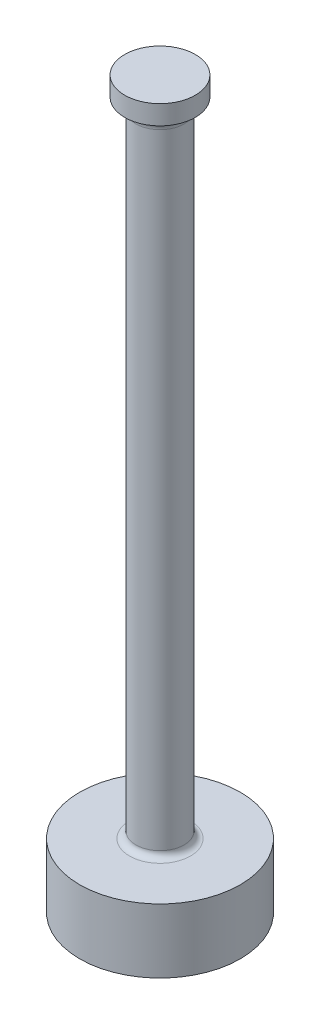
ISO-10303-21;
HEADER;
FILE_DESCRIPTION(('STEP AP214'),'2;1');
FILE_NAME('part.step','',(''),(''),'','','');
FILE_SCHEMA(('AUTOMOTIVE_DESIGN { 1 0 10303 214 1 1 1 1 }'));
ENDSEC;
DATA;
#1=APPLICATION_CONTEXT('core data for automotive mechanical design processes');
#2=APPLICATION_PROTOCOL_DEFINITION('international standard','automotive_design',2000,#1);
#3=PRODUCT_CONTEXT('',#1,'mechanical');
#4=PRODUCT('Part','Part','',(#3));
#5=PRODUCT_RELATED_PRODUCT_CATEGORY('part','',(#4));
#6=PRODUCT_DEFINITION_FORMATION('','',#4);
#7=PRODUCT_DEFINITION_CONTEXT('part definition',#1,'design');
#8=PRODUCT_DEFINITION('design','',#6,#7);
#9=PRODUCT_DEFINITION_SHAPE('','',#8);
#10=(LENGTH_UNIT() NAMED_UNIT(*) SI_UNIT(.MILLI.,.METRE.));
#11=(NAMED_UNIT(*) PLANE_ANGLE_UNIT() SI_UNIT($,.RADIAN.));
#12=(NAMED_UNIT(*) SI_UNIT($,.STERADIAN.) SOLID_ANGLE_UNIT());
#13=UNCERTAINTY_MEASURE_WITH_UNIT(LENGTH_MEASURE(1.E-05),#10,'distance_accuracy_value','');
#14=(GEOMETRIC_REPRESENTATION_CONTEXT(3) GLOBAL_UNCERTAINTY_ASSIGNED_CONTEXT((#13)) GLOBAL_UNIT_ASSIGNED_CONTEXT((#10,
#11,#12)) REPRESENTATION_CONTEXT('',''));
#15=CARTESIAN_POINT('',(0.,0.,0.));
#16=DIRECTION('',(0.,0.,1.));
#17=DIRECTION('',(1.,0.,0.));
#18=AXIS2_PLACEMENT_3D('',#15,#16,#17);
#19=CARTESIAN_POINT('',(0.,200.,0.));
#20=DIRECTION('',(0.,-1.,0.));
#21=DIRECTION('',(0.,0.,-1.));
#22=AXIS2_PLACEMENT_3D('',#19,#20,#21);
#23=CYLINDRICAL_SURFACE('',#22,250.);
#24=CARTESIAN_POINT('',(0.,200.,0.));
#25=DIRECTION('',(0.,1.,0.));
#26=DIRECTION('',(0.,0.,1.));
#27=AXIS2_PLACEMENT_3D('',#24,#25,#26);
#28=CIRCLE('',#27,250.);
#29=CARTESIAN_POINT('',(0.,200.,250.));
#30=VERTEX_POINT('',#29);
#31=EDGE_CURVE('E52',#30,#30,#28,.T.);
#32=ORIENTED_EDGE('',*,*,#31,.F.);
#33=EDGE_LOOP('',(#32));
#34=FACE_BOUND('',#33,.T.);
#35=CARTESIAN_POINT('',(0.,0.,0.));
#36=DIRECTION('',(0.,1.,0.));
#37=DIRECTION('',(0.,0.,1.));
#38=AXIS2_PLACEMENT_3D('',#35,#36,#37);
#39=CIRCLE('',#38,250.);
#40=CARTESIAN_POINT('',(0.,0.,250.));
#41=VERTEX_POINT('',#40);
#42=EDGE_CURVE('E55',#41,#41,#39,.T.);
#43=ORIENTED_EDGE('',*,*,#42,.T.);
#44=EDGE_LOOP('',(#43));
#45=FACE_BOUND('',#44,.T.);
#46=ADVANCED_FACE('F37',(#34,#45),#23,.T.);
#47=CARTESIAN_POINT('',(0.,200.,0.));
#48=DIRECTION('',(0.,1.,0.));
#49=DIRECTION('',(0.,0.,1.));
#50=AXIS2_PLACEMENT_3D('',#47,#48,#49);
#51=PLANE('',#50);
#52=CARTESIAN_POINT('',(0.,200.,0.));
#53=DIRECTION('',(0.,1.,0.));
#54=DIRECTION('',(0.,0.,1.));
#55=AXIS2_PLACEMENT_3D('',#52,#53,#54);
#56=CIRCLE('',#55,95.);
#57=CARTESIAN_POINT('',(0.,200.,95.));
#58=VERTEX_POINT('',#57);
#59=EDGE_CURVE('E44',#58,#58,#56,.F.);
#60=ORIENTED_EDGE('',*,*,#59,.T.);
#61=EDGE_LOOP('',(#60));
#62=FACE_BOUND('',#61,.T.);
#63=ORIENTED_EDGE('',*,*,#31,.T.);
#64=EDGE_LOOP('',(#63));
#65=FACE_BOUND('',#64,.T.);
#66=ADVANCED_FACE('F84',(#62,#65),#51,.T.);
#67=CARTESIAN_POINT('',(0.,0.,0.));
#68=DIRECTION('',(0.,1.,0.));
#69=DIRECTION('',(0.,0.,1.));
#70=AXIS2_PLACEMENT_3D('',#67,#68,#69);
#71=PLANE('',#70);
#72=ORIENTED_EDGE('',*,*,#42,.F.);
#73=EDGE_LOOP('',(#72));
#74=FACE_BOUND('',#73,.T.);
#75=ADVANCED_FACE('F91',(#74),#71,.F.);
#76=CARTESIAN_POINT('',(0.,2200.,0.));
#77=DIRECTION('',(0.,-1.,0.));
#78=DIRECTION('',(0.,0.,-1.));
#79=AXIS2_PLACEMENT_3D('',#76,#77,#78);
#80=CYLINDRICAL_SURFACE('',#79,75.);
#81=CARTESIAN_POINT('',(0.,2165.,0.));
#82=DIRECTION('',(0.,1.,0.));
#83=DIRECTION('',(0.,0.,1.));
#84=AXIS2_PLACEMENT_3D('',#81,#82,#83);
#85=CIRCLE('',#84,75.);
#86=CARTESIAN_POINT('',(0.,2165.,75.));
#87=VERTEX_POINT('',#86);
#88=EDGE_CURVE('E10',#87,#87,#85,.F.);
#89=ORIENTED_EDGE('',*,*,#88,.T.);
#90=EDGE_LOOP('',(#89));
#91=FACE_BOUND('',#90,.T.);
#92=CARTESIAN_POINT('',(0.,220.,0.));
#93=DIRECTION('',(0.,1.,0.));
#94=DIRECTION('',(0.,0.,1.));
#95=AXIS2_PLACEMENT_3D('',#92,#93,#94);
#96=CIRCLE('',#95,75.);
#97=CARTESIAN_POINT('',(0.,220.,75.));
#98=VERTEX_POINT('',#97);
#99=EDGE_CURVE('E48',#98,#98,#96,.T.);
#100=ORIENTED_EDGE('',*,*,#99,.T.);
#101=EDGE_LOOP('',(#100));
#102=FACE_BOUND('',#101,.T.);
#103=ADVANCED_FACE('F97',(#91,#102),#80,.T.);
#104=CARTESIAN_POINT('',(0.,220.,0.));
#105=DIRECTION('',(0.,1.,0.));
#106=DIRECTION('',(0.,0.,1.));
#107=AXIS2_PLACEMENT_3D('',#104,#105,#106);
#108=TOROIDAL_SURFACE('',#107,95.,20.);
#109=ORIENTED_EDGE('',*,*,#59,.F.);
#110=EDGE_LOOP('',(#109));
#111=FACE_BOUND('',#110,.T.);
#112=ORIENTED_EDGE('',*,*,#99,.F.);
#113=EDGE_LOOP('',(#112));
#114=FACE_BOUND('',#113,.T.);
#115=ADVANCED_FACE('F72',(#111,#114),#108,.F.);
#116=CARTESIAN_POINT('',(0.,2260.,0.));
#117=DIRECTION('',(0.,-1.,0.));
#118=DIRECTION('',(0.,0.,-1.));
#119=AXIS2_PLACEMENT_3D('',#116,#117,#118);
#120=CYLINDRICAL_SURFACE('',#119,110.);
#121=CARTESIAN_POINT('',(0.,2260.,0.));
#122=DIRECTION('',(0.,1.,0.));
#123=DIRECTION('',(0.,0.,1.));
#124=AXIS2_PLACEMENT_3D('',#121,#122,#123);
#125=CIRCLE('',#124,110.);
#126=CARTESIAN_POINT('',(0.,2260.,110.));
#127=VERTEX_POINT('',#126);
#128=EDGE_CURVE('E58',#127,#127,#125,.T.);
#129=ORIENTED_EDGE('',*,*,#128,.F.);
#130=EDGE_LOOP('',(#129));
#131=FACE_BOUND('',#130,.T.);
#132=CARTESIAN_POINT('',(0.,2200.,0.));
#133=DIRECTION('',(0.,1.,0.));
#134=DIRECTION('',(0.,0.,1.));
#135=AXIS2_PLACEMENT_3D('',#132,#133,#134);
#136=CIRCLE('',#135,110.);
#137=CARTESIAN_POINT('',(0.,2200.,110.));
#138=VERTEX_POINT('',#137);
#139=EDGE_CURVE('E61',#138,#138,#136,.T.);
#140=ORIENTED_EDGE('',*,*,#139,.T.);
#141=EDGE_LOOP('',(#140));
#142=FACE_BOUND('',#141,.T.);
#143=ADVANCED_FACE('F69',(#131,#142),#120,.T.);
#144=CARTESIAN_POINT('',(0.,2260.,0.));
#145=DIRECTION('',(0.,1.,0.));
#146=DIRECTION('',(0.,0.,1.));
#147=AXIS2_PLACEMENT_3D('',#144,#145,#146);
#148=PLANE('',#147);
#149=ORIENTED_EDGE('',*,*,#128,.T.);
#150=EDGE_LOOP('',(#149));
#151=FACE_BOUND('',#150,.T.);
#152=ADVANCED_FACE('F67',(#151),#148,.T.);
#153=CARTESIAN_POINT('',(0.,2165.,0.));
#154=DIRECTION('',(0.,1.,0.));
#155=DIRECTION('',(0.,0.,1.));
#156=AXIS2_PLACEMENT_3D('',#153,#154,#155);
#157=TOROIDAL_SURFACE('',#156,110.,35.);
#158=ORIENTED_EDGE('',*,*,#88,.F.);
#159=EDGE_LOOP('',(#158));
#160=FACE_BOUND('',#159,.T.);
#161=ORIENTED_EDGE('',*,*,#139,.F.);
#162=EDGE_LOOP('',(#161));
#163=FACE_BOUND('',#162,.T.);
#164=ADVANCED_FACE('F39',(#160,#163),#157,.F.);
#165=CLOSED_SHELL('',(#46,#66,#75,#103,#115,#143,#152,#164));
#166=MANIFOLD_SOLID_BREP('B2',#165);
#167=ADVANCED_BREP_SHAPE_REPRESENTATION('',(#18,#166),#14);
#168=SHAPE_DEFINITION_REPRESENTATION(#9,#167);
ENDSEC;
END-ISO-10303-21;
